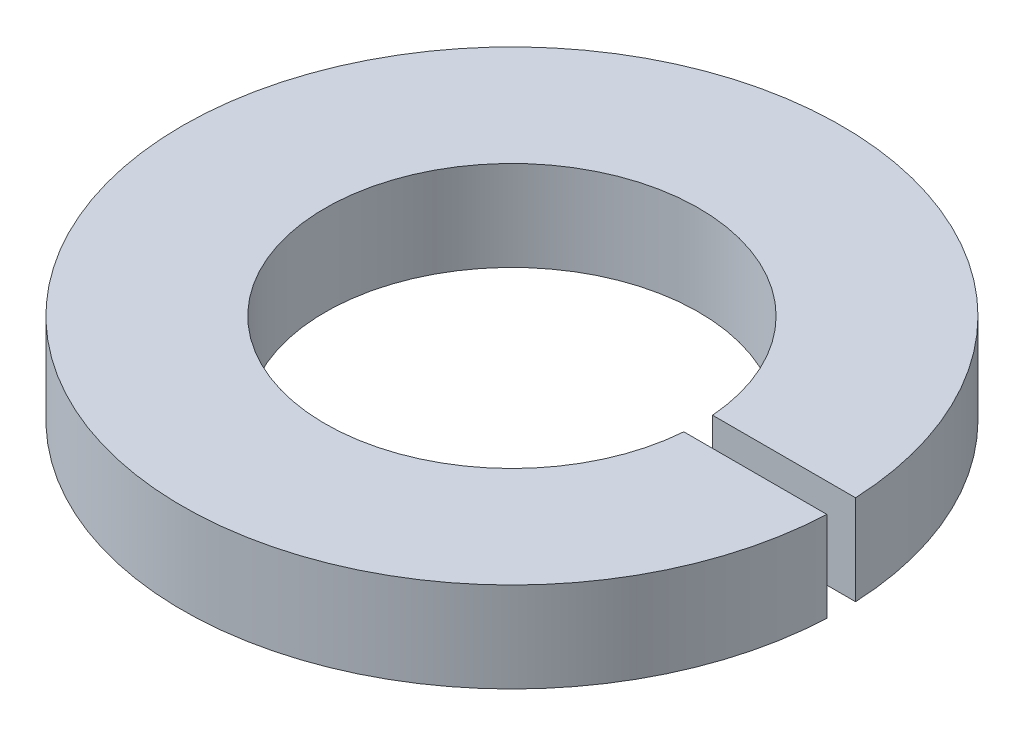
ISO-10303-21;
HEADER;
FILE_DESCRIPTION(('STEP AP214'),'2;1');
FILE_NAME('part.step','',(''),(''),'','','');
FILE_SCHEMA(('AUTOMOTIVE_DESIGN { 1 0 10303 214 1 1 1 1 }'));
ENDSEC;
DATA;
#1=APPLICATION_CONTEXT('core data for automotive mechanical design processes');
#2=APPLICATION_PROTOCOL_DEFINITION('international standard','automotive_design',2000,#1);
#3=PRODUCT_CONTEXT('',#1,'mechanical');
#4=PRODUCT('Part','Part','',(#3));
#5=PRODUCT_RELATED_PRODUCT_CATEGORY('part','',(#4));
#6=PRODUCT_DEFINITION_FORMATION('','',#4);
#7=PRODUCT_DEFINITION_CONTEXT('part definition',#1,'design');
#8=PRODUCT_DEFINITION('design','',#6,#7);
#9=PRODUCT_DEFINITION_SHAPE('','',#8);
#10=(LENGTH_UNIT() NAMED_UNIT(*) SI_UNIT(.MILLI.,.METRE.));
#11=(NAMED_UNIT(*) PLANE_ANGLE_UNIT() SI_UNIT($,.RADIAN.));
#12=(NAMED_UNIT(*) SI_UNIT($,.STERADIAN.) SOLID_ANGLE_UNIT());
#13=UNCERTAINTY_MEASURE_WITH_UNIT(LENGTH_MEASURE(1.E-05),#10,'distance_accuracy_value','');
#14=(GEOMETRIC_REPRESENTATION_CONTEXT(3) GLOBAL_UNCERTAINTY_ASSIGNED_CONTEXT((#13)) GLOBAL_UNIT_ASSIGNED_CONTEXT((#10,
#11,#12)) REPRESENTATION_CONTEXT('',''));
#15=CARTESIAN_POINT('',(0.,0.,0.));
#16=DIRECTION('',(0.,0.,1.));
#17=DIRECTION('',(1.,0.,0.));
#18=AXIS2_PLACEMENT_3D('',#15,#16,#17);
#19=CARTESIAN_POINT('',(0.,2.3876,0.));
#20=DIRECTION('',(0.,1.,0.));
#21=DIRECTION('',(0.,0.,1.));
#22=AXIS2_PLACEMENT_3D('',#19,#20,#21);
#23=PLANE('',#22);
#24=CARTESIAN_POINT('',(0.,2.3876,0.));
#25=DIRECTION('',(0.,1.,0.));
#26=DIRECTION('',(0.,0.,1.));
#27=AXIS2_PLACEMENT_3D('',#24,#25,#26);
#28=CIRCLE('',#27,8.7376);
#29=CARTESIAN_POINT('',(8.72928936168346,2.3876,-0.380999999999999));
#30=VERTEX_POINT('',#29);
#31=CARTESIAN_POINT('',(8.72928936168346,2.3876,0.381000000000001));
#32=VERTEX_POINT('',#31);
#33=EDGE_CURVE('E84',#30,#32,#28,.T.);
#34=ORIENTED_EDGE('',*,*,#33,.T.);
#35=DIRECTION('',(-1.,0.,0.));
#36=VECTOR('',#35,1.);
#37=CARTESIAN_POINT('',(8.72928936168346,2.3876,0.381000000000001));
#38=LINE('',#37,#36);
#39=CARTESIAN_POINT('',(4.93832441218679,2.3876,0.381000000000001));
#40=VERTEX_POINT('',#39);
#41=EDGE_CURVE('E87',#32,#40,#38,.T.);
#42=ORIENTED_EDGE('',*,*,#41,.T.);
#43=CARTESIAN_POINT('',(0.,2.3876,0.));
#44=DIRECTION('',(0.,1.,0.));
#45=DIRECTION('',(0.,0.,1.));
#46=AXIS2_PLACEMENT_3D('',#43,#44,#45);
#47=CIRCLE('',#46,4.953);
#48=CARTESIAN_POINT('',(4.93832441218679,2.3876,-0.381));
#49=VERTEX_POINT('',#48);
#50=EDGE_CURVE('E86',#49,#40,#47,.T.);
#51=ORIENTED_EDGE('',*,*,#50,.F.);
#52=DIRECTION('',(-1.,0.,0.));
#53=VECTOR('',#52,1.);
#54=CARTESIAN_POINT('',(8.72928936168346,2.3876,-0.380999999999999));
#55=LINE('',#54,#53);
#56=EDGE_CURVE('E53',#30,#49,#55,.T.);
#57=ORIENTED_EDGE('',*,*,#56,.F.);
#58=EDGE_LOOP('',(#34,#42,#51,#57));
#59=FACE_BOUND('',#58,.T.);
#60=ADVANCED_FACE('F31',(#59),#23,.T.);
#61=CARTESIAN_POINT('',(0.,0.,0.));
#62=DIRECTION('',(0.,1.,0.));
#63=DIRECTION('',(0.,0.,1.));
#64=AXIS2_PLACEMENT_3D('',#61,#62,#63);
#65=PLANE('',#64);
#66=DIRECTION('',(-1.,0.,0.));
#67=VECTOR('',#66,1.);
#68=CARTESIAN_POINT('',(8.72928936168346,0.,0.381000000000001));
#69=LINE('',#68,#67);
#70=CARTESIAN_POINT('',(8.72928936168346,0.,0.381000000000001));
#71=VERTEX_POINT('',#70);
#72=CARTESIAN_POINT('',(4.93832441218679,0.,0.381000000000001));
#73=VERTEX_POINT('',#72);
#74=EDGE_CURVE('E46',#71,#73,#69,.T.);
#75=ORIENTED_EDGE('',*,*,#74,.F.);
#76=CARTESIAN_POINT('',(0.,0.,0.));
#77=DIRECTION('',(0.,1.,0.));
#78=DIRECTION('',(0.,0.,1.));
#79=AXIS2_PLACEMENT_3D('',#76,#77,#78);
#80=CIRCLE('',#79,8.7376);
#81=CARTESIAN_POINT('',(8.72928936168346,0.,-0.380999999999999));
#82=VERTEX_POINT('',#81);
#83=EDGE_CURVE('E90',#82,#71,#80,.T.);
#84=ORIENTED_EDGE('',*,*,#83,.F.);
#85=DIRECTION('',(-1.,0.,0.));
#86=VECTOR('',#85,1.);
#87=CARTESIAN_POINT('',(8.72928936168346,0.,-0.380999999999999));
#88=LINE('',#87,#86);
#89=CARTESIAN_POINT('',(4.93832441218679,0.,-0.381));
#90=VERTEX_POINT('',#89);
#91=EDGE_CURVE('E72',#82,#90,#88,.T.);
#92=ORIENTED_EDGE('',*,*,#91,.T.);
#93=CARTESIAN_POINT('',(0.,0.,0.));
#94=DIRECTION('',(0.,1.,0.));
#95=DIRECTION('',(0.,0.,1.));
#96=AXIS2_PLACEMENT_3D('',#93,#94,#95);
#97=CIRCLE('',#96,4.953);
#98=EDGE_CURVE('E77',#90,#73,#97,.T.);
#99=ORIENTED_EDGE('',*,*,#98,.T.);
#100=EDGE_LOOP('',(#75,#84,#92,#99));
#101=FACE_BOUND('',#100,.T.);
#102=ADVANCED_FACE('F104',(#101),#65,.F.);
#103=CARTESIAN_POINT('',(0.,2.3876,0.));
#104=DIRECTION('',(0.,-1.,0.));
#105=DIRECTION('',(0.,0.,-1.));
#106=AXIS2_PLACEMENT_3D('',#103,#104,#105);
#107=CYLINDRICAL_SURFACE('',#106,8.7376);
#108=DIRECTION('',(0.,1.,0.));
#109=VECTOR('',#108,1.);
#110=CARTESIAN_POINT('',(8.72928936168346,0.,0.381000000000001));
#111=LINE('',#110,#109);
#112=EDGE_CURVE('E78',#71,#32,#111,.T.);
#113=ORIENTED_EDGE('',*,*,#112,.T.);
#114=ORIENTED_EDGE('',*,*,#33,.F.);
#115=DIRECTION('',(0.,1.,0.));
#116=VECTOR('',#115,1.);
#117=CARTESIAN_POINT('',(8.72928936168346,0.,-0.380999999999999));
#118=LINE('',#117,#116);
#119=EDGE_CURVE('E69',#82,#30,#118,.T.);
#120=ORIENTED_EDGE('',*,*,#119,.F.);
#121=ORIENTED_EDGE('',*,*,#83,.T.);
#122=EDGE_LOOP('',(#113,#114,#120,#121));
#123=FACE_BOUND('',#122,.T.);
#124=ADVANCED_FACE('F33',(#123),#107,.T.);
#125=CARTESIAN_POINT('',(0.,2.3876,0.));
#126=DIRECTION('',(0.,-1.,0.));
#127=DIRECTION('',(0.,0.,-1.));
#128=AXIS2_PLACEMENT_3D('',#125,#126,#127);
#129=CYLINDRICAL_SURFACE('',#128,4.953);
#130=ORIENTED_EDGE('',*,*,#50,.T.);
#131=DIRECTION('',(0.,-1.,0.));
#132=VECTOR('',#131,1.);
#133=CARTESIAN_POINT('',(4.93832441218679,2.3876,0.381000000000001));
#134=LINE('',#133,#132);
#135=EDGE_CURVE('E11',#40,#73,#134,.T.);
#136=ORIENTED_EDGE('',*,*,#135,.T.);
#137=ORIENTED_EDGE('',*,*,#98,.F.);
#138=DIRECTION('',(0.,-1.,0.));
#139=VECTOR('',#138,1.);
#140=CARTESIAN_POINT('',(4.93832441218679,2.3876,-0.381));
#141=LINE('',#140,#139);
#142=EDGE_CURVE('E39',#49,#90,#141,.T.);
#143=ORIENTED_EDGE('',*,*,#142,.F.);
#144=EDGE_LOOP('',(#130,#136,#137,#143));
#145=FACE_BOUND('',#144,.T.);
#146=ADVANCED_FACE('F101',(#145),#129,.F.);
#147=CARTESIAN_POINT('',(8.72928936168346,0.,-0.380999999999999));
#148=DIRECTION('',(0.,0.,-1.));
#149=DIRECTION('',(-1.,0.,0.));
#150=AXIS2_PLACEMENT_3D('',#147,#148,#149);
#151=PLANE('',#150);
#152=ORIENTED_EDGE('',*,*,#142,.T.);
#153=ORIENTED_EDGE('',*,*,#91,.F.);
#154=ORIENTED_EDGE('',*,*,#119,.T.);
#155=ORIENTED_EDGE('',*,*,#56,.T.);
#156=EDGE_LOOP('',(#152,#153,#154,#155));
#157=FACE_BOUND('',#156,.T.);
#158=ADVANCED_FACE('F70',(#157),#151,.F.);
#159=CARTESIAN_POINT('',(8.72928936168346,0.,0.381000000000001));
#160=DIRECTION('',(0.,0.,-1.));
#161=DIRECTION('',(-1.,0.,0.));
#162=AXIS2_PLACEMENT_3D('',#159,#160,#161);
#163=PLANE('',#162);
#164=ORIENTED_EDGE('',*,*,#41,.F.);
#165=ORIENTED_EDGE('',*,*,#112,.F.);
#166=ORIENTED_EDGE('',*,*,#74,.T.);
#167=ORIENTED_EDGE('',*,*,#135,.F.);
#168=EDGE_LOOP('',(#164,#165,#166,#167));
#169=FACE_BOUND('',#168,.T.);
#170=ADVANCED_FACE('F114',(#169),#163,.T.);
#171=CLOSED_SHELL('',(#60,#102,#124,#146,#158,#170));
#172=MANIFOLD_SOLID_BREP('B2',#171);
#173=ADVANCED_BREP_SHAPE_REPRESENTATION('',(#18,#172),#14);
#174=SHAPE_DEFINITION_REPRESENTATION(#9,#173);
ENDSEC;
END-ISO-10303-21;
